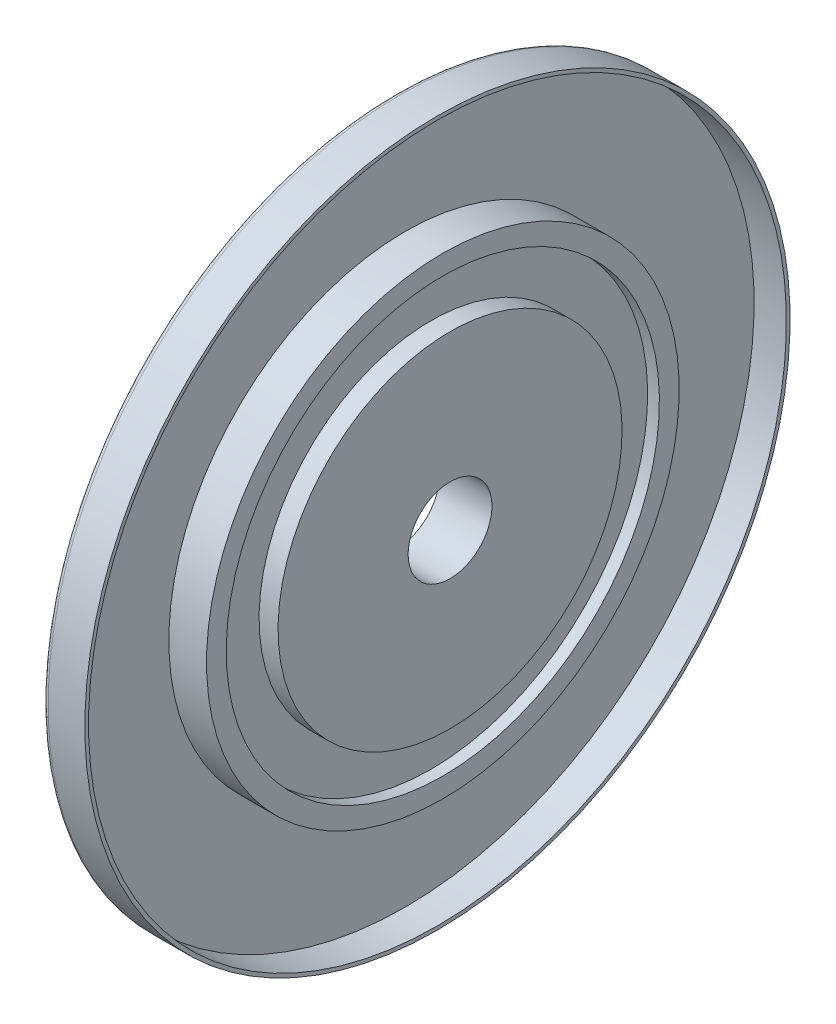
ISO-10303-21;
HEADER;
FILE_DESCRIPTION(('STEP AP214'),'2;1');
FILE_NAME('part.step','',(''),(''),'','','');
FILE_SCHEMA(('AUTOMOTIVE_DESIGN { 1 0 10303 214 1 1 1 1 }'));
ENDSEC;
DATA;
#1=APPLICATION_CONTEXT('core data for automotive mechanical design processes');
#2=APPLICATION_PROTOCOL_DEFINITION('international standard','automotive_design',2000,#1);
#3=PRODUCT_CONTEXT('',#1,'mechanical');
#4=PRODUCT('Part','Part','',(#3));
#5=PRODUCT_RELATED_PRODUCT_CATEGORY('part','',(#4));
#6=PRODUCT_DEFINITION_FORMATION('','',#4);
#7=PRODUCT_DEFINITION_CONTEXT('part definition',#1,'design');
#8=PRODUCT_DEFINITION('design','',#6,#7);
#9=PRODUCT_DEFINITION_SHAPE('','',#8);
#10=(LENGTH_UNIT() NAMED_UNIT(*) SI_UNIT(.MILLI.,.METRE.));
#11=(NAMED_UNIT(*) PLANE_ANGLE_UNIT() SI_UNIT($,.RADIAN.));
#12=(NAMED_UNIT(*) SI_UNIT($,.STERADIAN.) SOLID_ANGLE_UNIT());
#13=UNCERTAINTY_MEASURE_WITH_UNIT(LENGTH_MEASURE(1.E-05),#10,'distance_accuracy_value','');
#14=(GEOMETRIC_REPRESENTATION_CONTEXT(3) GLOBAL_UNCERTAINTY_ASSIGNED_CONTEXT((#13)) GLOBAL_UNIT_ASSIGNED_CONTEXT((#10,
#11,#12)) REPRESENTATION_CONTEXT('',''));
#15=CARTESIAN_POINT('',(0.,0.,0.));
#16=DIRECTION('',(0.,0.,1.));
#17=DIRECTION('',(1.,0.,0.));
#18=AXIS2_PLACEMENT_3D('',#15,#16,#17);
#19=CARTESIAN_POINT('',(-10.70625,0.,0.));
#20=DIRECTION('',(-1.,0.,0.));
#21=DIRECTION('',(0.,-1.,0.));
#22=AXIS2_PLACEMENT_3D('',#19,#20,#21);
#23=TOROIDAL_SURFACE('',#22,53.8749428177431,0.79375);
#24=CARTESIAN_POINT('',(-11.5,0.,0.));
#25=DIRECTION('',(-1.,0.,0.));
#26=DIRECTION('',(0.,-1.,0.));
#27=AXIS2_PLACEMENT_3D('',#24,#25,#26);
#28=CIRCLE('',#27,53.8749428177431);
#29=CARTESIAN_POINT('',(-11.5,-53.8749428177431,0.));
#30=VERTEX_POINT('',#29);
#31=EDGE_CURVE('E114',#30,#30,#28,.T.);
#32=ORIENTED_EDGE('',*,*,#31,.F.);
#33=EDGE_LOOP('',(#32));
#34=FACE_BOUND('',#33,.T.);
#35=CARTESIAN_POINT('',(-10.70625,0.,0.));
#36=DIRECTION('',(-1.,0.,0.));
#37=DIRECTION('',(0.,-1.,0.));
#38=AXIS2_PLACEMENT_3D('',#35,#36,#37);
#39=CIRCLE('',#38,54.6686928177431);
#40=CARTESIAN_POINT('',(-10.70625,-54.6686928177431,0.));
#41=VERTEX_POINT('',#40);
#42=EDGE_CURVE('E10',#41,#41,#39,.T.);
#43=ORIENTED_EDGE('',*,*,#42,.T.);
#44=EDGE_LOOP('',(#43));
#45=FACE_BOUND('',#44,.T.);
#46=ADVANCED_FACE('F39',(#34,#45),#23,.T.);
#47=CARTESIAN_POINT('',(0.,0.,0.));
#48=DIRECTION('',(-1.,0.,0.));
#49=DIRECTION('',(0.,-1.,0.));
#50=AXIS2_PLACEMENT_3D('',#47,#48,#49);
#51=CYLINDRICAL_SURFACE('',#50,54.6686928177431);
#52=ORIENTED_EDGE('',*,*,#42,.F.);
#53=EDGE_LOOP('',(#52));
#54=FACE_BOUND('',#53,.T.);
#55=CARTESIAN_POINT('',(-5.00000000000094,0.,0.));
#56=DIRECTION('',(-1.,0.,0.));
#57=DIRECTION('',(0.,-1.,0.));
#58=AXIS2_PLACEMENT_3D('',#55,#56,#57);
#59=CIRCLE('',#58,54.6686928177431);
#60=CARTESIAN_POINT('',(-5.00000000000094,-54.6686928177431,0.));
#61=VERTEX_POINT('',#60);
#62=EDGE_CURVE('E46',#61,#61,#59,.T.);
#63=ORIENTED_EDGE('',*,*,#62,.T.);
#64=EDGE_LOOP('',(#63));
#65=FACE_BOUND('',#64,.T.);
#66=ADVANCED_FACE('F122',(#54,#65),#51,.T.);
#67=CARTESIAN_POINT('',(-5.00000000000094,54.102,0.));
#68=DIRECTION('',(-1.,0.,0.));
#69=DIRECTION('',(0.,-1.,0.));
#70=AXIS2_PLACEMENT_3D('',#67,#68,#69);
#71=PLANE('',#70);
#72=ORIENTED_EDGE('',*,*,#62,.F.);
#73=EDGE_LOOP('',(#72));
#74=FACE_BOUND('',#73,.T.);
#75=CARTESIAN_POINT('',(-5.00000000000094,0.,0.));
#76=DIRECTION('',(-1.,0.,0.));
#77=DIRECTION('',(0.,-1.,0.));
#78=AXIS2_PLACEMENT_3D('',#75,#76,#77);
#79=CIRCLE('',#78,54.102);
#80=CARTESIAN_POINT('',(-5.00000000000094,-54.102,0.));
#81=VERTEX_POINT('',#80);
#82=EDGE_CURVE('E52',#81,#81,#79,.T.);
#83=ORIENTED_EDGE('',*,*,#82,.T.);
#84=EDGE_LOOP('',(#83));
#85=FACE_BOUND('',#84,.T.);
#86=ADVANCED_FACE('F126',(#74,#85),#71,.F.);
#87=CARTESIAN_POINT('',(0.,0.,0.));
#88=DIRECTION('',(-1.,0.,0.));
#89=DIRECTION('',(0.,-1.,0.));
#90=AXIS2_PLACEMENT_3D('',#87,#88,#89);
#91=CYLINDRICAL_SURFACE('',#90,54.102);
#92=ORIENTED_EDGE('',*,*,#82,.F.);
#93=EDGE_LOOP('',(#92));
#94=FACE_BOUND('',#93,.T.);
#95=CARTESIAN_POINT('',(-10.0076,0.,0.));
#96=DIRECTION('',(-1.,0.,0.));
#97=DIRECTION('',(0.,-1.,0.));
#98=AXIS2_PLACEMENT_3D('',#95,#96,#97);
#99=CIRCLE('',#98,54.102);
#100=CARTESIAN_POINT('',(-10.0076,-54.102,0.));
#101=VERTEX_POINT('',#100);
#102=EDGE_CURVE('E56',#101,#101,#99,.T.);
#103=ORIENTED_EDGE('',*,*,#102,.T.);
#104=EDGE_LOOP('',(#103));
#105=FACE_BOUND('',#104,.T.);
#106=ADVANCED_FACE('F131',(#94,#105),#91,.F.);
#107=CARTESIAN_POINT('',(-10.0076,54.102,0.));
#108=DIRECTION('',(-1.,0.,0.));
#109=DIRECTION('',(0.,-1.,0.));
#110=AXIS2_PLACEMENT_3D('',#107,#108,#109);
#111=PLANE('',#110);
#112=ORIENTED_EDGE('',*,*,#102,.F.);
#113=EDGE_LOOP('',(#112));
#114=FACE_BOUND('',#113,.T.);
#115=CARTESIAN_POINT('',(-10.0076,0.,0.));
#116=DIRECTION('',(-1.,0.,0.));
#117=DIRECTION('',(0.,-1.,0.));
#118=AXIS2_PLACEMENT_3D('',#115,#116,#117);
#119=CIRCLE('',#118,36.6395);
#120=CARTESIAN_POINT('',(-10.0076,-36.6395,0.));
#121=VERTEX_POINT('',#120);
#122=EDGE_CURVE('E62',#121,#121,#119,.T.);
#123=ORIENTED_EDGE('',*,*,#122,.T.);
#124=EDGE_LOOP('',(#123));
#125=FACE_BOUND('',#124,.T.);
#126=ADVANCED_FACE('F137',(#114,#125),#111,.F.);
#127=CARTESIAN_POINT('',(0.,0.,0.));
#128=DIRECTION('',(-1.,0.,0.));
#129=DIRECTION('',(0.,-1.,0.));
#130=AXIS2_PLACEMENT_3D('',#127,#128,#129);
#131=CYLINDRICAL_SURFACE('',#130,36.6395);
#132=ORIENTED_EDGE('',*,*,#122,.F.);
#133=EDGE_LOOP('',(#132));
#134=FACE_BOUND('',#133,.T.);
#135=CARTESIAN_POINT('',(-4.1656,0.,0.));
#136=DIRECTION('',(-1.,0.,0.));
#137=DIRECTION('',(0.,-1.,0.));
#138=AXIS2_PLACEMENT_3D('',#135,#136,#137);
#139=CIRCLE('',#138,36.6395);
#140=CARTESIAN_POINT('',(-4.1656,-36.6395,0.));
#141=VERTEX_POINT('',#140);
#142=EDGE_CURVE('E66',#141,#141,#139,.T.);
#143=ORIENTED_EDGE('',*,*,#142,.T.);
#144=EDGE_LOOP('',(#143));
#145=FACE_BOUND('',#144,.T.);
#146=ADVANCED_FACE('F141',(#134,#145),#131,.T.);
#147=CARTESIAN_POINT('',(-4.1656,36.6395,0.));
#148=DIRECTION('',(-1.,0.,0.));
#149=DIRECTION('',(0.,-1.,0.));
#150=AXIS2_PLACEMENT_3D('',#147,#148,#149);
#151=PLANE('',#150);
#152=ORIENTED_EDGE('',*,*,#142,.F.);
#153=EDGE_LOOP('',(#152));
#154=FACE_BOUND('',#153,.T.);
#155=CARTESIAN_POINT('',(-4.1656,0.,0.));
#156=DIRECTION('',(-1.,0.,0.));
#157=DIRECTION('',(0.,-1.,0.));
#158=AXIS2_PLACEMENT_3D('',#155,#156,#157);
#159=CIRCLE('',#158,33.5788);
#160=CARTESIAN_POINT('',(-4.1656,-33.5788,0.));
#161=VERTEX_POINT('',#160);
#162=EDGE_CURVE('E70',#161,#161,#159,.T.);
#163=ORIENTED_EDGE('',*,*,#162,.T.);
#164=EDGE_LOOP('',(#163));
#165=FACE_BOUND('',#164,.T.);
#166=ADVANCED_FACE('F145',(#154,#165),#151,.F.);
#167=CARTESIAN_POINT('',(0.,0.,0.));
#168=DIRECTION('',(-1.,0.,0.));
#169=DIRECTION('',(0.,-1.,0.));
#170=AXIS2_PLACEMENT_3D('',#167,#168,#169);
#171=CYLINDRICAL_SURFACE('',#170,33.5788);
#172=ORIENTED_EDGE('',*,*,#162,.F.);
#173=EDGE_LOOP('',(#172));
#174=FACE_BOUND('',#173,.T.);
#175=CARTESIAN_POINT('',(-5.9944,0.,0.));
#176=DIRECTION('',(-1.,0.,0.));
#177=DIRECTION('',(0.,-1.,0.));
#178=AXIS2_PLACEMENT_3D('',#175,#176,#177);
#179=CIRCLE('',#178,33.5788);
#180=CARTESIAN_POINT('',(-5.9944,-33.5788,0.));
#181=VERTEX_POINT('',#180);
#182=EDGE_CURVE('E74',#181,#181,#179,.T.);
#183=ORIENTED_EDGE('',*,*,#182,.T.);
#184=EDGE_LOOP('',(#183));
#185=FACE_BOUND('',#184,.T.);
#186=ADVANCED_FACE('F149',(#174,#185),#171,.F.);
#187=CARTESIAN_POINT('',(-5.9944,26.67,0.));
#188=DIRECTION('',(-1.,0.,0.));
#189=DIRECTION('',(0.,-1.,0.));
#190=AXIS2_PLACEMENT_3D('',#187,#188,#189);
#191=PLANE('',#190);
#192=ORIENTED_EDGE('',*,*,#182,.F.);
#193=EDGE_LOOP('',(#192));
#194=FACE_BOUND('',#193,.T.);
#195=CARTESIAN_POINT('',(-5.9944,0.,0.));
#196=DIRECTION('',(-1.,0.,0.));
#197=DIRECTION('',(0.,-1.,0.));
#198=AXIS2_PLACEMENT_3D('',#195,#196,#197);
#199=CIRCLE('',#198,26.67);
#200=CARTESIAN_POINT('',(-5.9944,-26.67,0.));
#201=VERTEX_POINT('',#200);
#202=EDGE_CURVE('E78',#201,#201,#199,.T.);
#203=ORIENTED_EDGE('',*,*,#202,.T.);
#204=EDGE_LOOP('',(#203));
#205=FACE_BOUND('',#204,.T.);
#206=ADVANCED_FACE('F153',(#194,#205),#191,.F.);
#207=CARTESIAN_POINT('',(0.,0.,0.));
#208=DIRECTION('',(-1.,0.,0.));
#209=DIRECTION('',(0.,-1.,0.));
#210=AXIS2_PLACEMENT_3D('',#207,#208,#209);
#211=CYLINDRICAL_SURFACE('',#210,26.67);
#212=ORIENTED_EDGE('',*,*,#202,.F.);
#213=EDGE_LOOP('',(#212));
#214=FACE_BOUND('',#213,.T.);
#215=CARTESIAN_POINT('',(-3.048,0.,0.));
#216=DIRECTION('',(-1.,0.,0.));
#217=DIRECTION('',(0.,-1.,0.));
#218=AXIS2_PLACEMENT_3D('',#215,#216,#217);
#219=CIRCLE('',#218,26.67);
#220=CARTESIAN_POINT('',(-3.048,-26.67,0.));
#221=VERTEX_POINT('',#220);
#222=EDGE_CURVE('E82',#221,#221,#219,.T.);
#223=ORIENTED_EDGE('',*,*,#222,.T.);
#224=EDGE_LOOP('',(#223));
#225=FACE_BOUND('',#224,.T.);
#226=ADVANCED_FACE('F157',(#214,#225),#211,.T.);
#227=CARTESIAN_POINT('',(-3.048,26.67,0.));
#228=DIRECTION('',(-1.,0.,0.));
#229=DIRECTION('',(0.,-1.,0.));
#230=AXIS2_PLACEMENT_3D('',#227,#228,#229);
#231=PLANE('',#230);
#232=ORIENTED_EDGE('',*,*,#222,.F.);
#233=EDGE_LOOP('',(#232));
#234=FACE_BOUND('',#233,.T.);
#235=CARTESIAN_POINT('',(-3.048,0.,0.));
#236=DIRECTION('',(-1.,0.,0.));
#237=DIRECTION('',(0.,-1.,0.));
#238=AXIS2_PLACEMENT_3D('',#235,#236,#237);
#239=CIRCLE('',#238,6.5);
#240=CARTESIAN_POINT('',(-3.048,-6.5,0.));
#241=VERTEX_POINT('',#240);
#242=EDGE_CURVE('E86',#241,#241,#239,.T.);
#243=ORIENTED_EDGE('',*,*,#242,.T.);
#244=EDGE_LOOP('',(#243));
#245=FACE_BOUND('',#244,.T.);
#246=ADVANCED_FACE('F161',(#234,#245),#231,.F.);
#247=CARTESIAN_POINT('',(0.,0.,0.));
#248=DIRECTION('',(-1.,0.,0.));
#249=DIRECTION('',(0.,-1.,0.));
#250=AXIS2_PLACEMENT_3D('',#247,#248,#249);
#251=CYLINDRICAL_SURFACE('',#250,6.5);
#252=ORIENTED_EDGE('',*,*,#242,.F.);
#253=EDGE_LOOP('',(#252));
#254=FACE_BOUND('',#253,.T.);
#255=CARTESIAN_POINT('',(-11.2061000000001,0.,0.));
#256=DIRECTION('',(-1.,0.,0.));
#257=DIRECTION('',(0.,-1.,0.));
#258=AXIS2_PLACEMENT_3D('',#255,#256,#257);
#259=CIRCLE('',#258,6.5);
#260=CARTESIAN_POINT('',(-11.2061000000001,-6.5,0.));
#261=VERTEX_POINT('',#260);
#262=EDGE_CURVE('E90',#261,#261,#259,.T.);
#263=ORIENTED_EDGE('',*,*,#262,.T.);
#264=EDGE_LOOP('',(#263));
#265=FACE_BOUND('',#264,.T.);
#266=ADVANCED_FACE('F165',(#254,#265),#251,.F.);
#267=CARTESIAN_POINT('',(-7.06755,0.,0.));
#268=DIRECTION('',(1.,0.,0.));
#269=DIRECTION('',(0.,1.,0.));
#270=AXIS2_PLACEMENT_3D('',#267,#268,#269);
#271=CONICAL_SURFACE('',#270,12.7,0.982211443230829);
#272=ORIENTED_EDGE('',*,*,#262,.F.);
#273=EDGE_LOOP('',(#272));
#274=FACE_BOUND('',#273,.T.);
#275=CARTESIAN_POINT('',(-7.06755,0.,0.));
#276=DIRECTION('',(-1.,0.,0.));
#277=DIRECTION('',(0.,-1.,0.));
#278=AXIS2_PLACEMENT_3D('',#275,#276,#277);
#279=CIRCLE('',#278,12.7);
#280=CARTESIAN_POINT('',(-7.06755,-12.7,0.));
#281=VERTEX_POINT('',#280);
#282=EDGE_CURVE('E94',#281,#281,#279,.T.);
#283=ORIENTED_EDGE('',*,*,#282,.T.);
#284=EDGE_LOOP('',(#283));
#285=FACE_BOUND('',#284,.T.);
#286=ADVANCED_FACE('F169',(#274,#285),#271,.T.);
#287=CARTESIAN_POINT('',(0.,0.,0.));
#288=DIRECTION('',(-1.,0.,0.));
#289=DIRECTION('',(0.,-1.,0.));
#290=AXIS2_PLACEMENT_3D('',#287,#288,#289);
#291=CYLINDRICAL_SURFACE('',#290,12.7);
#292=ORIENTED_EDGE('',*,*,#282,.F.);
#293=EDGE_LOOP('',(#292));
#294=FACE_BOUND('',#293,.T.);
#295=CARTESIAN_POINT('',(-4.699,0.,0.));
#296=DIRECTION('',(-1.,0.,0.));
#297=DIRECTION('',(0.,-1.,0.));
#298=AXIS2_PLACEMENT_3D('',#295,#296,#297);
#299=CIRCLE('',#298,12.7);
#300=CARTESIAN_POINT('',(-4.699,-12.7,0.));
#301=VERTEX_POINT('',#300);
#302=EDGE_CURVE('E98',#301,#301,#299,.T.);
#303=ORIENTED_EDGE('',*,*,#302,.T.);
#304=EDGE_LOOP('',(#303));
#305=FACE_BOUND('',#304,.T.);
#306=ADVANCED_FACE('F173',(#294,#305),#291,.T.);
#307=CARTESIAN_POINT('',(-4.699,12.7,0.));
#308=DIRECTION('',(1.,0.,0.));
#309=DIRECTION('',(0.,1.,0.));
#310=AXIS2_PLACEMENT_3D('',#307,#308,#309);
#311=PLANE('',#310);
#312=ORIENTED_EDGE('',*,*,#302,.F.);
#313=EDGE_LOOP('',(#312));
#314=FACE_BOUND('',#313,.T.);
#315=CARTESIAN_POINT('',(-4.699,0.,0.));
#316=DIRECTION('',(-1.,0.,0.));
#317=DIRECTION('',(0.,-1.,0.));
#318=AXIS2_PLACEMENT_3D('',#315,#316,#317);
#319=CIRCLE('',#318,18.034);
#320=CARTESIAN_POINT('',(-4.699,-18.034,0.));
#321=VERTEX_POINT('',#320);
#322=EDGE_CURVE('E102',#321,#321,#319,.T.);
#323=ORIENTED_EDGE('',*,*,#322,.T.);
#324=EDGE_LOOP('',(#323));
#325=FACE_BOUND('',#324,.T.);
#326=ADVANCED_FACE('F177',(#314,#325),#311,.F.);
#327=CARTESIAN_POINT('',(0.,0.,0.));
#328=DIRECTION('',(-1.,0.,0.));
#329=DIRECTION('',(0.,-1.,0.));
#330=AXIS2_PLACEMENT_3D('',#327,#328,#329);
#331=CYLINDRICAL_SURFACE('',#330,18.034);
#332=ORIENTED_EDGE('',*,*,#322,.F.);
#333=EDGE_LOOP('',(#332));
#334=FACE_BOUND('',#333,.T.);
#335=CARTESIAN_POINT('',(-10.70625,0.,0.));
#336=DIRECTION('',(-1.,0.,0.));
#337=DIRECTION('',(0.,-1.,0.));
#338=AXIS2_PLACEMENT_3D('',#335,#336,#337);
#339=CIRCLE('',#338,18.034);
#340=CARTESIAN_POINT('',(-10.70625,-18.034,0.));
#341=VERTEX_POINT('',#340);
#342=EDGE_CURVE('E106',#341,#341,#339,.T.);
#343=ORIENTED_EDGE('',*,*,#342,.T.);
#344=EDGE_LOOP('',(#343));
#345=FACE_BOUND('',#344,.T.);
#346=ADVANCED_FACE('F181',(#334,#345),#331,.F.);
#347=CARTESIAN_POINT('',(-10.70625,0.,0.));
#348=DIRECTION('',(-1.,0.,0.));
#349=DIRECTION('',(0.,-1.,0.));
#350=AXIS2_PLACEMENT_3D('',#347,#348,#349);
#351=TOROIDAL_SURFACE('',#350,18.82775,0.793749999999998);
#352=ORIENTED_EDGE('',*,*,#342,.F.);
#353=EDGE_LOOP('',(#352));
#354=FACE_BOUND('',#353,.T.);
#355=CARTESIAN_POINT('',(-11.5,0.,0.));
#356=DIRECTION('',(-1.,0.,0.));
#357=DIRECTION('',(0.,-1.,0.));
#358=AXIS2_PLACEMENT_3D('',#355,#356,#357);
#359=CIRCLE('',#358,18.82775);
#360=CARTESIAN_POINT('',(-11.5,-18.82775,0.));
#361=VERTEX_POINT('',#360);
#362=EDGE_CURVE('E110',#361,#361,#359,.T.);
#363=ORIENTED_EDGE('',*,*,#362,.T.);
#364=EDGE_LOOP('',(#363));
#365=FACE_BOUND('',#364,.T.);
#366=ADVANCED_FACE('F185',(#354,#365),#351,.T.);
#367=CARTESIAN_POINT('',(-11.5,18.82775,0.));
#368=DIRECTION('',(1.,0.,0.));
#369=DIRECTION('',(0.,1.,0.));
#370=AXIS2_PLACEMENT_3D('',#367,#368,#369);
#371=PLANE('',#370);
#372=ORIENTED_EDGE('',*,*,#362,.F.);
#373=EDGE_LOOP('',(#372));
#374=FACE_BOUND('',#373,.T.);
#375=ORIENTED_EDGE('',*,*,#31,.T.);
#376=EDGE_LOOP('',(#375));
#377=FACE_BOUND('',#376,.T.);
#378=ADVANCED_FACE('F119',(#374,#377),#371,.F.);
#379=CLOSED_SHELL('',(#46,#66,#86,#106,#126,#146,#166,#186,#206,#226,#246,#266,#286,#306,#326,
#346,#366,#378));
#380=MANIFOLD_SOLID_BREP('B2',#379);
#381=ADVANCED_BREP_SHAPE_REPRESENTATION('',(#18,#380),#14);
#382=SHAPE_DEFINITION_REPRESENTATION(#9,#381);
ENDSEC;
END-ISO-10303-21;
